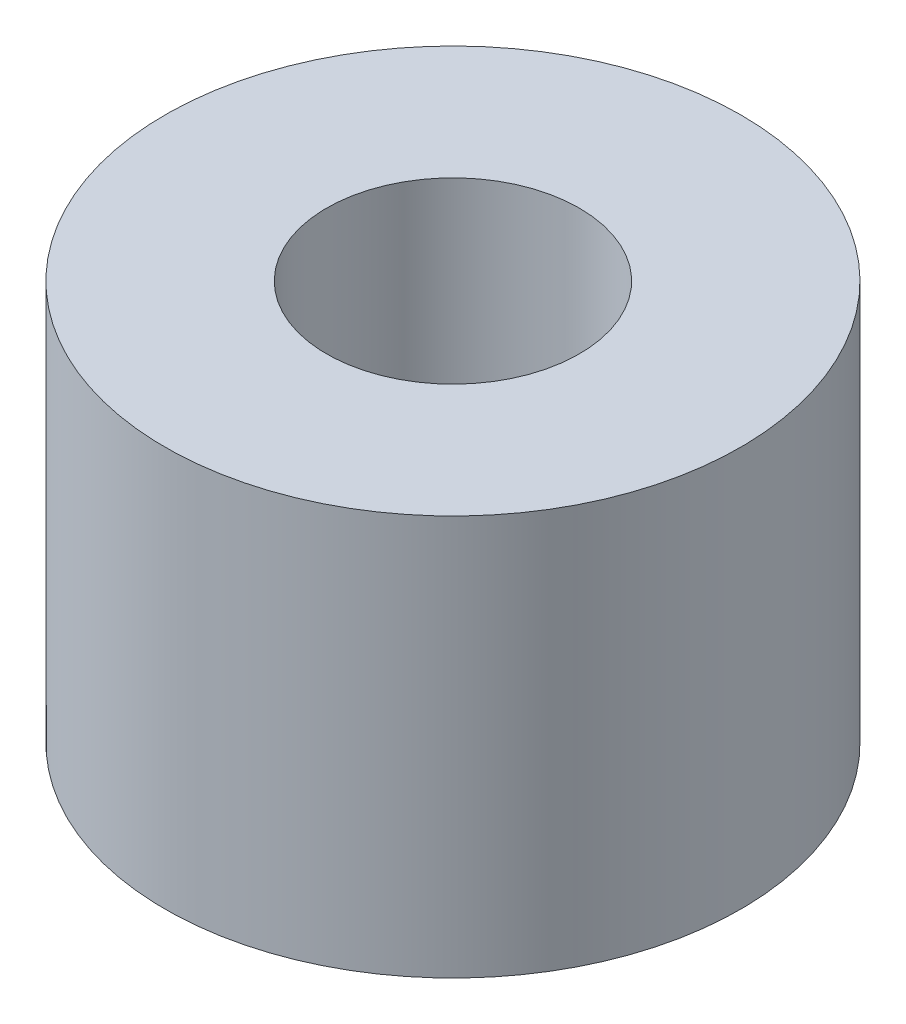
ISO-10303-21;
HEADER;
FILE_DESCRIPTION(('STEP AP214'),'2;1');
FILE_NAME('part.step','',(''),(''),'','','');
FILE_SCHEMA(('AUTOMOTIVE_DESIGN { 1 0 10303 214 1 1 1 1 }'));
ENDSEC;
DATA;
#1=APPLICATION_CONTEXT('core data for automotive mechanical design processes');
#2=APPLICATION_PROTOCOL_DEFINITION('international standard','automotive_design',2000,#1);
#3=PRODUCT_CONTEXT('',#1,'mechanical');
#4=PRODUCT('Part','Part','',(#3));
#5=PRODUCT_RELATED_PRODUCT_CATEGORY('part','',(#4));
#6=PRODUCT_DEFINITION_FORMATION('','',#4);
#7=PRODUCT_DEFINITION_CONTEXT('part definition',#1,'design');
#8=PRODUCT_DEFINITION('design','',#6,#7);
#9=PRODUCT_DEFINITION_SHAPE('','',#8);
#10=(LENGTH_UNIT() NAMED_UNIT(*) SI_UNIT(.MILLI.,.METRE.));
#11=(NAMED_UNIT(*) PLANE_ANGLE_UNIT() SI_UNIT($,.RADIAN.));
#12=(NAMED_UNIT(*) SI_UNIT($,.STERADIAN.) SOLID_ANGLE_UNIT());
#13=UNCERTAINTY_MEASURE_WITH_UNIT(LENGTH_MEASURE(1.E-05),#10,'distance_accuracy_value','');
#14=(GEOMETRIC_REPRESENTATION_CONTEXT(3) GLOBAL_UNCERTAINTY_ASSIGNED_CONTEXT((#13)) GLOBAL_UNIT_ASSIGNED_CONTEXT((#10,
#11,#12)) REPRESENTATION_CONTEXT('',''));
#15=CARTESIAN_POINT('',(0.,0.,0.));
#16=DIRECTION('',(0.,0.,1.));
#17=DIRECTION('',(1.,0.,0.));
#18=AXIS2_PLACEMENT_3D('',#15,#16,#17);
#19=CARTESIAN_POINT('',(0.,0.,0.));
#20=DIRECTION('',(0.,-1.,0.));
#21=DIRECTION('',(0.,0.,-1.));
#22=AXIS2_PLACEMENT_3D('',#19,#20,#21);
#23=CYLINDRICAL_SURFACE('',#22,82.);
#24=CARTESIAN_POINT('',(0.,0.,0.));
#25=DIRECTION('',(0.,-1.,0.));
#26=DIRECTION('',(0.,0.,-1.));
#27=AXIS2_PLACEMENT_3D('',#24,#25,#26);
#28=CIRCLE('',#27,82.);
#29=CARTESIAN_POINT('',(0.,0.,-82.));
#30=VERTEX_POINT('',#29);
#31=EDGE_CURVE('E47',#30,#30,#28,.T.);
#32=ORIENTED_EDGE('',*,*,#31,.F.);
#33=EDGE_LOOP('',(#32));
#34=FACE_BOUND('',#33,.T.);
#35=CARTESIAN_POINT('',(0.,114.,0.));
#36=DIRECTION('',(0.,-1.,0.));
#37=DIRECTION('',(0.,0.,-1.));
#38=AXIS2_PLACEMENT_3D('',#35,#36,#37);
#39=CIRCLE('',#38,82.);
#40=CARTESIAN_POINT('',(0.,114.,-82.));
#41=VERTEX_POINT('',#40);
#42=EDGE_CURVE('E10',#41,#41,#39,.T.);
#43=ORIENTED_EDGE('',*,*,#42,.T.);
#44=EDGE_LOOP('',(#43));
#45=FACE_BOUND('',#44,.T.);
#46=ADVANCED_FACE('F33',(#34,#45),#23,.T.);
#47=CARTESIAN_POINT('',(-82.,114.,0.));
#48=DIRECTION('',(0.,-1.,0.));
#49=DIRECTION('',(0.,0.,-1.));
#50=AXIS2_PLACEMENT_3D('',#47,#48,#49);
#51=PLANE('',#50);
#52=ORIENTED_EDGE('',*,*,#42,.F.);
#53=EDGE_LOOP('',(#52));
#54=FACE_BOUND('',#53,.T.);
#55=CARTESIAN_POINT('',(0.,114.,0.));
#56=DIRECTION('',(0.,-1.,0.));
#57=DIRECTION('',(0.,0.,-1.));
#58=AXIS2_PLACEMENT_3D('',#55,#56,#57);
#59=CIRCLE('',#58,36.);
#60=CARTESIAN_POINT('',(0.,114.,-36.));
#61=VERTEX_POINT('',#60);
#62=EDGE_CURVE('E39',#61,#61,#59,.T.);
#63=ORIENTED_EDGE('',*,*,#62,.T.);
#64=EDGE_LOOP('',(#63));
#65=FACE_BOUND('',#64,.T.);
#66=ADVANCED_FACE('F56',(#54,#65),#51,.F.);
#67=CARTESIAN_POINT('',(0.,0.,0.));
#68=DIRECTION('',(0.,-1.,0.));
#69=DIRECTION('',(0.,0.,-1.));
#70=AXIS2_PLACEMENT_3D('',#67,#68,#69);
#71=CYLINDRICAL_SURFACE('',#70,36.);
#72=ORIENTED_EDGE('',*,*,#62,.F.);
#73=EDGE_LOOP('',(#72));
#74=FACE_BOUND('',#73,.T.);
#75=CARTESIAN_POINT('',(0.,0.,0.));
#76=DIRECTION('',(0.,-1.,0.));
#77=DIRECTION('',(0.,0.,-1.));
#78=AXIS2_PLACEMENT_3D('',#75,#76,#77);
#79=CIRCLE('',#78,36.);
#80=CARTESIAN_POINT('',(0.,0.,-36.));
#81=VERTEX_POINT('',#80);
#82=EDGE_CURVE('E43',#81,#81,#79,.T.);
#83=ORIENTED_EDGE('',*,*,#82,.T.);
#84=EDGE_LOOP('',(#83));
#85=FACE_BOUND('',#84,.T.);
#86=ADVANCED_FACE('F60',(#74,#85),#71,.F.);
#87=CARTESIAN_POINT('',(-36.,0.,0.));
#88=DIRECTION('',(0.,1.,0.));
#89=DIRECTION('',(0.,0.,1.));
#90=AXIS2_PLACEMENT_3D('',#87,#88,#89);
#91=PLANE('',#90);
#92=ORIENTED_EDGE('',*,*,#82,.F.);
#93=EDGE_LOOP('',(#92));
#94=FACE_BOUND('',#93,.T.);
#95=ORIENTED_EDGE('',*,*,#31,.T.);
#96=EDGE_LOOP('',(#95));
#97=FACE_BOUND('',#96,.T.);
#98=ADVANCED_FACE('F53',(#94,#97),#91,.F.);
#99=CLOSED_SHELL('',(#46,#66,#86,#98));
#100=MANIFOLD_SOLID_BREP('B2',#99);
#101=ADVANCED_BREP_SHAPE_REPRESENTATION('',(#18,#100),#14);
#102=SHAPE_DEFINITION_REPRESENTATION(#9,#101);
ENDSEC;
END-ISO-10303-21;
